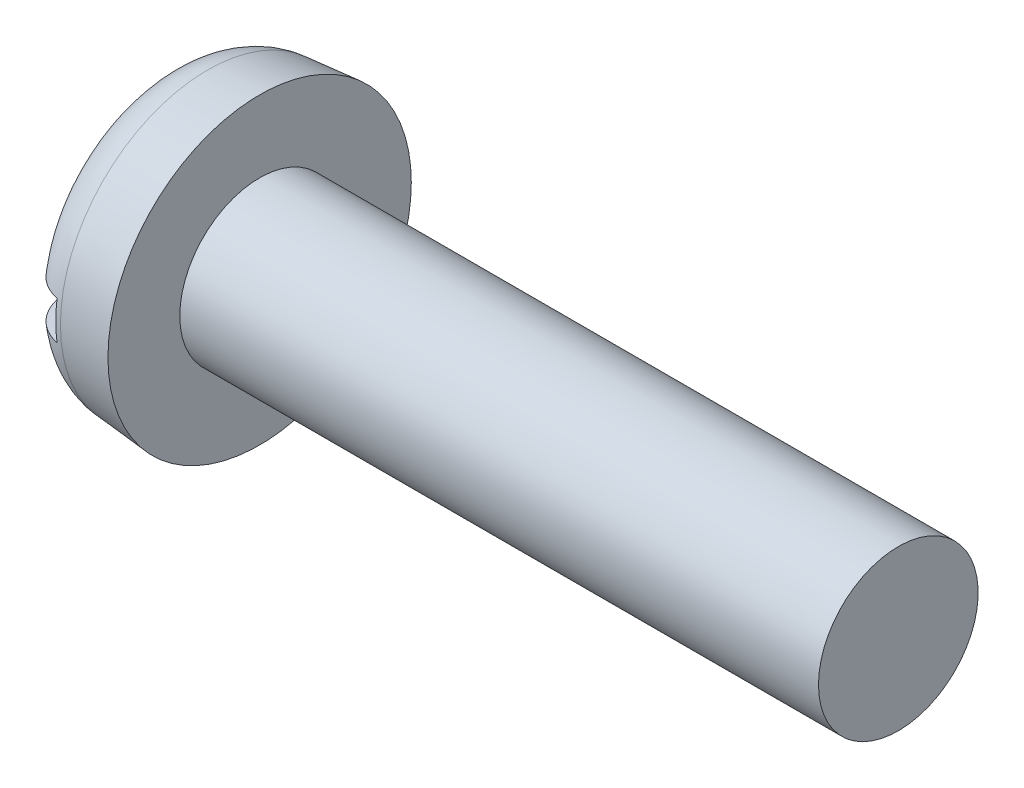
ISO-10303-21;
HEADER;
FILE_DESCRIPTION(('STEP AP214'),'2;1');
FILE_NAME('part.step','',(''),(''),'','','');
FILE_SCHEMA(('AUTOMOTIVE_DESIGN { 1 0 10303 214 1 1 1 1 }'));
ENDSEC;
DATA;
#1=APPLICATION_CONTEXT('core data for automotive mechanical design processes');
#2=APPLICATION_PROTOCOL_DEFINITION('international standard','automotive_design',2000,#1);
#3=PRODUCT_CONTEXT('',#1,'mechanical');
#4=PRODUCT('Part','Part','',(#3));
#5=PRODUCT_RELATED_PRODUCT_CATEGORY('part','',(#4));
#6=PRODUCT_DEFINITION_FORMATION('','',#4);
#7=PRODUCT_DEFINITION_CONTEXT('part definition',#1,'design');
#8=PRODUCT_DEFINITION('design','',#6,#7);
#9=PRODUCT_DEFINITION_SHAPE('','',#8);
#10=(LENGTH_UNIT() NAMED_UNIT(*) SI_UNIT(.MILLI.,.METRE.));
#11=(NAMED_UNIT(*) PLANE_ANGLE_UNIT() SI_UNIT($,.RADIAN.));
#12=(NAMED_UNIT(*) SI_UNIT($,.STERADIAN.) SOLID_ANGLE_UNIT());
#13=UNCERTAINTY_MEASURE_WITH_UNIT(LENGTH_MEASURE(1.E-05),#10,'distance_accuracy_value','');
#14=(GEOMETRIC_REPRESENTATION_CONTEXT(3) GLOBAL_UNCERTAINTY_ASSIGNED_CONTEXT((#13)) GLOBAL_UNIT_ASSIGNED_CONTEXT((#10,
#11,#12)) REPRESENTATION_CONTEXT('',''));
#15=CARTESIAN_POINT('',(0.,0.,0.));
#16=DIRECTION('',(0.,0.,1.));
#17=DIRECTION('',(1.,0.,0.));
#18=AXIS2_PLACEMENT_3D('',#15,#16,#17);
#19=CARTESIAN_POINT('',(0.,0.,0.));
#20=DIRECTION('',(-1.,0.,0.));
#21=DIRECTION('',(0.,0.,1.));
#22=AXIS2_PLACEMENT_3D('',#19,#20,#21);
#23=PLANE('',#22);
#24=DIRECTION('',(0.,0.,-1.));
#25=VECTOR('',#24,1.);
#26=CARTESIAN_POINT('',(0.,0.599999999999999,4.75));
#27=LINE('',#26,#25);
#28=CARTESIAN_POINT('',(0.,0.599999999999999,3.05466870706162));
#29=VERTEX_POINT('',#28);
#30=CARTESIAN_POINT('',(0.,0.599999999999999,-3.05466870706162));
#31=VERTEX_POINT('',#30);
#32=EDGE_CURVE('E85',#29,#31,#27,.T.);
#33=ORIENTED_EDGE('',*,*,#32,.F.);
#34=CARTESIAN_POINT('',(0.,0.,0.));
#35=DIRECTION('',(-1.,0.,0.));
#36=DIRECTION('',(0.,0.,1.));
#37=AXIS2_PLACEMENT_3D('',#34,#35,#36);
#38=CIRCLE('',#37,3.11303724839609);
#39=EDGE_CURVE('E91',#29,#31,#38,.T.);
#40=ORIENTED_EDGE('',*,*,#39,.T.);
#41=EDGE_LOOP('',(#33,#40));
#42=FACE_BOUND('',#41,.T.);
#43=ADVANCED_FACE('F32',(#42),#23,.T.);
#44=CARTESIAN_POINT('',(-25.4,0.,0.));
#45=DIRECTION('',(-1.,0.,0.));
#46=DIRECTION('',(0.,0.,1.));
#47=AXIS2_PLACEMENT_3D('',#44,#45,#46);
#48=CYLINDRICAL_SURFACE('',#47,2.5);
#49=CARTESIAN_POINT('',(23.,0.,0.));
#50=DIRECTION('',(-1.,0.,0.));
#51=DIRECTION('',(0.,0.,1.));
#52=AXIS2_PLACEMENT_3D('',#49,#50,#51);
#53=CIRCLE('',#52,2.5);
#54=CARTESIAN_POINT('',(23.,0.,2.5));
#55=VERTEX_POINT('',#54);
#56=EDGE_CURVE('E92',#55,#55,#53,.T.);
#57=ORIENTED_EDGE('',*,*,#56,.T.);
#58=EDGE_LOOP('',(#57));
#59=FACE_BOUND('',#58,.T.);
#60=CARTESIAN_POINT('',(3.,0.,0.));
#61=DIRECTION('',(-1.,0.,0.));
#62=DIRECTION('',(0.,0.,1.));
#63=AXIS2_PLACEMENT_3D('',#60,#61,#62);
#64=CIRCLE('',#63,2.5);
#65=CARTESIAN_POINT('',(3.,0.,2.5));
#66=VERTEX_POINT('',#65);
#67=EDGE_CURVE('E149',#66,#66,#64,.T.);
#68=ORIENTED_EDGE('',*,*,#67,.F.);
#69=EDGE_LOOP('',(#68));
#70=FACE_BOUND('',#69,.T.);
#71=ADVANCED_FACE('F137',(#59,#70),#48,.T.);
#72=CARTESIAN_POINT('',(23.,2.5,0.));
#73=DIRECTION('',(1.,0.,0.));
#74=DIRECTION('',(0.,0.,-1.));
#75=AXIS2_PLACEMENT_3D('',#72,#73,#74);
#76=PLANE('',#75);
#77=ORIENTED_EDGE('',*,*,#56,.F.);
#78=EDGE_LOOP('',(#77));
#79=FACE_BOUND('',#78,.T.);
#80=ADVANCED_FACE('F135',(#79),#76,.T.);
#81=DIRECTION('',(0.,0.,1.));
#82=VECTOR('',#81,1.);
#83=CARTESIAN_POINT('',(0.,-0.599999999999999,-4.75));
#84=LINE('',#83,#82);
#85=CARTESIAN_POINT('',(0.,-0.599999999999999,-3.05466870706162));
#86=VERTEX_POINT('',#85);
#87=CARTESIAN_POINT('',(0.,-0.6,3.05466870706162));
#88=VERTEX_POINT('',#87);
#89=EDGE_CURVE('E76',#86,#88,#84,.T.);
#90=ORIENTED_EDGE('',*,*,#89,.F.);
#91=EDGE_CURVE('E83',#86,#88,#38,.T.);
#92=ORIENTED_EDGE('',*,*,#91,.T.);
#93=EDGE_LOOP('',(#90,#92));
#94=FACE_BOUND('',#93,.T.);
#95=ADVANCED_FACE('F82',(#94),#23,.T.);
#96=CARTESIAN_POINT('',(0.,0.,0.));
#97=DIRECTION('',(1.,0.,0.));
#98=DIRECTION('',(0.,0.,-1.));
#99=AXIS2_PLACEMENT_3D('',#96,#97,#98);
#100=CONICAL_SURFACE('',#99,4.48753400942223,0.0872664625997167);
#101=CARTESIAN_POINT('',(1.36926638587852,0.,0.));
#102=DIRECTION('',(-1.,0.,0.));
#103=DIRECTION('',(0.,0.,1.));
#104=AXIS2_PLACEMENT_3D('',#101,#102,#103);
#105=CIRCLE('',#104,4.60732929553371);
#106=CARTESIAN_POINT('',(1.36926638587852,0.,4.60732929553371));
#107=VERTEX_POINT('',#106);
#108=EDGE_CURVE('E95',#107,#107,#105,.F.);
#109=ORIENTED_EDGE('',*,*,#108,.T.);
#110=EDGE_LOOP('',(#109));
#111=FACE_BOUND('',#110,.T.);
#112=CARTESIAN_POINT('',(3.,0.,0.));
#113=DIRECTION('',(-1.,0.,0.));
#114=DIRECTION('',(0.,0.,1.));
#115=AXIS2_PLACEMENT_3D('',#112,#113,#114);
#116=CIRCLE('',#115,4.75);
#117=CARTESIAN_POINT('',(3.,0.,4.75));
#118=VERTEX_POINT('',#117);
#119=EDGE_CURVE('E97',#118,#118,#116,.T.);
#120=ORIENTED_EDGE('',*,*,#119,.T.);
#121=EDGE_LOOP('',(#120));
#122=FACE_BOUND('',#121,.T.);
#123=ADVANCED_FACE('F128',(#111,#122),#100,.T.);
#124=CARTESIAN_POINT('',(3.,2.5,0.));
#125=DIRECTION('',(-1.,0.,0.));
#126=DIRECTION('',(0.,0.,1.));
#127=AXIS2_PLACEMENT_3D('',#124,#125,#126);
#128=PLANE('',#127);
#129=ORIENTED_EDGE('',*,*,#119,.F.);
#130=EDGE_LOOP('',(#129));
#131=FACE_BOUND('',#130,.T.);
#132=ORIENTED_EDGE('',*,*,#67,.T.);
#133=EDGE_LOOP('',(#132));
#134=FACE_BOUND('',#133,.T.);
#135=ADVANCED_FACE('F124',(#131,#134),#128,.F.);
#136=CARTESIAN_POINT('',(1.5,0.,0.));
#137=DIRECTION('',(-1.,0.,0.));
#138=DIRECTION('',(0.,0.,1.));
#139=AXIS2_PLACEMENT_3D('',#136,#137,#138);
#140=TOROIDAL_SURFACE('',#139,3.11303724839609,1.5);
#141=CARTESIAN_POINT('',(0.474243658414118,0.599999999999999,-4.16448807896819));
#142=CARTESIAN_POINT('',(0.535197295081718,0.599999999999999,-4.2222007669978));
#143=CARTESIAN_POINT('',(0.601040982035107,0.599999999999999,-4.27483380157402));
#144=CARTESIAN_POINT('',(0.740675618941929,0.599999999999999,-4.36835495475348));
#145=CARTESIAN_POINT('',(0.814475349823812,0.599999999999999,-4.40922990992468));
#146=CARTESIAN_POINT('',(0.967890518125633,0.599999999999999,-4.47797693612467));
#147=CARTESIAN_POINT('',(1.04750461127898,0.599999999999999,-4.50585200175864));
#148=CARTESIAN_POINT('',(1.21027286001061,0.599999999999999,-4.54777716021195));
#149=CARTESIAN_POINT('',(1.29342617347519,0.599999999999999,-4.56183052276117));
#150=CARTESIAN_POINT('',(1.46061786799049,0.599999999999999,-4.57568541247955));
#151=CARTESIAN_POINT('',(1.54465212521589,0.599999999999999,-4.57553672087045));
#152=CARTESIAN_POINT('',(1.71150157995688,0.599999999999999,-4.56111544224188));
#153=CARTESIAN_POINT('',(1.79431675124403,0.599999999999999,-4.546842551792));
#154=CARTESIAN_POINT('',(1.95628107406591,0.599999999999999,-4.50461633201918));
#155=CARTESIAN_POINT('',(2.03543426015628,0.599999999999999,-4.47667847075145));
#156=CARTESIAN_POINT('',(2.18794473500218,0.599999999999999,-4.40794662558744));
#157=CARTESIAN_POINT('',(2.26130200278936,0.599999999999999,-4.36715259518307));
#158=CARTESIAN_POINT('',(2.40037319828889,0.599999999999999,-4.27376142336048));
#159=CARTESIAN_POINT('',(2.46606492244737,0.599999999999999,-4.22113122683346));
#160=CARTESIAN_POINT('',(2.58775416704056,0.599999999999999,-4.10565865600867));
#161=CARTESIAN_POINT('',(2.64375146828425,0.599999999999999,-4.04281605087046));
#162=CARTESIAN_POINT('',(2.7448997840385,0.599999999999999,-3.90824759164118));
#163=CARTESIAN_POINT('',(2.78997229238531,0.599999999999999,-3.83646274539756));
#164=CARTESIAN_POINT('',(2.86758143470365,0.599999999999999,-3.6864129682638));
#165=CARTESIAN_POINT('',(2.90011748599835,0.599999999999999,-3.60814773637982));
#166=CARTESIAN_POINT('',(2.95215516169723,0.599999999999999,-3.44640006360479));
#167=CARTESIAN_POINT('',(2.9715017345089,0.599999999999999,-3.36286776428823));
#168=CARTESIAN_POINT('',(2.99613620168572,0.599999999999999,-3.19375865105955));
#169=CARTESIAN_POINT('',(3.00142305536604,0.599999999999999,-3.10818168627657));
#170=CARTESIAN_POINT('',(2.9978948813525,0.599999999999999,-2.93593785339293));
#171=CARTESIAN_POINT('',(2.98885075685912,0.599999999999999,-2.84927570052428));
#172=CARTESIAN_POINT('',(2.95661294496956,0.599999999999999,-2.67862588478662));
#173=CARTESIAN_POINT('',(2.93341783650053,0.599999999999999,-2.59463849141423));
#174=CARTESIAN_POINT('',(2.87305940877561,0.599999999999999,-2.43009011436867));
#175=CARTESIAN_POINT('',(2.8356478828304,0.599999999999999,-2.3496201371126));
#176=CARTESIAN_POINT('',(2.74798933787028,0.599999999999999,-2.1959917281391));
#177=CARTESIAN_POINT('',(2.69774036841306,0.599999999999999,-2.12283440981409));
#178=CARTESIAN_POINT('',(2.58515210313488,0.599999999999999,-1.98517825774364));
#179=CARTESIAN_POINT('',(2.52268993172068,0.599999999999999,-1.92077976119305));
#180=CARTESIAN_POINT('',(2.3876474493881,0.599999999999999,-1.80360821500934));
#181=CARTESIAN_POINT('',(2.31506700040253,0.599999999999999,-1.75083532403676));
#182=CARTESIAN_POINT('',(2.16324197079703,0.599999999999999,-1.65981326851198));
#183=CARTESIAN_POINT('',(2.08415844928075,0.599999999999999,-1.62129637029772));
#184=CARTESIAN_POINT('',(1.92036681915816,0.599999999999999,-1.55909823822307));
#185=CARTESIAN_POINT('',(1.83566227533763,0.599999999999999,-1.53540769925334));
#186=CARTESIAN_POINT('',(1.66868507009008,0.599999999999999,-1.50512561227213));
#187=CARTESIAN_POINT('',(1.58658829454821,0.599999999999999,-1.4975631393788));
#188=CARTESIAN_POINT('',(1.42235866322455,0.599999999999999,-1.49703912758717));
#189=CARTESIAN_POINT('',(1.34022582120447,0.599999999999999,-1.50407401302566));
#190=CARTESIAN_POINT('',(1.18200056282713,0.599999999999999,-1.53172166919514));
#191=CARTESIAN_POINT('',(1.10580089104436,0.599999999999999,-1.55172937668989));
#192=CARTESIAN_POINT('',(0.957649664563,0.599999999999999,-1.60381093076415));
#193=CARTESIAN_POINT('',(0.885698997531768,0.599999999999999,-1.63588728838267));
#194=CARTESIAN_POINT('',(0.745245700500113,0.599999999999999,-1.71223681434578));
#195=CARTESIAN_POINT('',(0.676958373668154,0.599999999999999,-1.75690511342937));
#196=CARTESIAN_POINT('',(0.548253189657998,0.599999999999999,-1.85641398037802));
#197=CARTESIAN_POINT('',(0.487837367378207,0.599999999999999,-1.91125716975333));
#198=CARTESIAN_POINT('',(0.372604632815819,0.599999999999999,-2.0333995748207));
#199=CARTESIAN_POINT('',(0.318393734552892,0.599999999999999,-2.10127142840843));
#200=CARTESIAN_POINT('',(0.22172170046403,0.599999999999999,-2.24492747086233));
#201=CARTESIAN_POINT('',(0.179262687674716,0.599999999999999,-2.32071308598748));
#202=CARTESIAN_POINT('',(0.106126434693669,0.599999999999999,-2.48060945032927));
#203=CARTESIAN_POINT('',(0.0758504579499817,0.599999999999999,-2.56490423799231));
#204=CARTESIAN_POINT('',(0.0299480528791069,0.599999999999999,-2.737393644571));
#205=CARTESIAN_POINT('',(0.0143211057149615,0.599999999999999,-2.82558812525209));
#206=CARTESIAN_POINT('',(-0.00166405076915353,0.599999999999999,-3.00295249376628));
#207=CARTESIAN_POINT('',(-0.0020913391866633,0.599999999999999,-3.09211612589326));
#208=CARTESIAN_POINT('',(0.012315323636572,0.599999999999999,-3.26923006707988));
#209=CARTESIAN_POINT('',(0.0271518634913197,0.599999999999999,-3.35718016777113));
#210=CARTESIAN_POINT('',(0.0713942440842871,0.599999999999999,-3.52770551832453));
#211=CARTESIAN_POINT('',(0.100543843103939,0.599999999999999,-3.61034739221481));
#212=CARTESIAN_POINT('',(0.172532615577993,0.599999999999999,-3.7693538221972));
#213=CARTESIAN_POINT('',(0.215353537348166,0.599999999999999,-3.84572657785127));
#214=CARTESIAN_POINT('',(0.294810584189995,0.599999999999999,-3.9625299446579));
#215=CARTESIAN_POINT('',(0.327631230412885,0.599999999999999,-4.00560511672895));
#216=CARTESIAN_POINT('',(0.397705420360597,0.599999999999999,-4.08798619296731));
#217=CARTESIAN_POINT('',(0.434958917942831,0.599999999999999,-4.12729213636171));
#218=CARTESIAN_POINT('',(0.474243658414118,0.599999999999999,-4.16448807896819));
#219=B_SPLINE_CURVE_WITH_KNOTS('',3,(#141,#142,#143,#144,#145,#146,#147,#148,#149,#150,#151,
#152,#153,#154,#155,#156,#157,#158,#159,#160,#161,#162,#163,#164,#165,#166,#167,#168,#169,#170,
#171,#172,#173,#174,#175,#176,#177,#178,#179,#180,#181,#182,#183,#184,#185,#186,#187,#188,#189,
#190,#191,#192,#193,#194,#195,#196,#197,#198,#199,#200,#201,#202,#203,#204,#205,#206,#207,#208,
#209,#210,#211,#212,#213,#214,#215,#216,#217,#218),.UNSPECIFIED.,.T.,.F.,(4,2,2,2,2,2,2,2,2,2,2,
2,2,2,2,2,2,2,2,2,2,2,2,2,2,2,2,2,2,2,2,2,2,2,2,2,2,2,4),(0.,0.251627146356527,
0.503534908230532,0.755384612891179,1.00717472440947,1.25808229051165,1.50899524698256,
1.75962483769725,2.01025533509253,2.26159466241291,2.5129396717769,2.76604060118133,
3.01915329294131,3.27519243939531,3.53125053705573,3.79144347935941,4.05166255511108,
4.31665070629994,4.58167914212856,4.84952563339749,5.1173757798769,5.37990411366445,
5.64226751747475,5.88833003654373,6.13433228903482,6.36961414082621,6.60494497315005,
6.84869102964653,7.09249997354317,7.35191672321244,7.61138030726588,7.87880123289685,
8.14621268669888,8.41240865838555,8.67864978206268,8.94028930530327,9.20158098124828,
9.36375686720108,9.52593106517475),.UNSPECIFIED.);
#220=CARTESIAN_POINT('',(1.2,0.599999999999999,-4.54328342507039));
#221=VERTEX_POINT('',#220);
#222=EDGE_CURVE('E11',#31,#221,#219,.T.);
#223=ORIENTED_EDGE('',*,*,#222,.F.);
#224=ORIENTED_EDGE('',*,*,#39,.F.);
#225=CARTESIAN_POINT('',(0.642058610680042,0.599999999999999,1.78444467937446));
#226=CARTESIAN_POINT('',(0.708203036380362,0.599999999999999,1.73578880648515));
#227=CARTESIAN_POINT('',(0.778279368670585,0.599999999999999,1.69241067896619));
#228=CARTESIAN_POINT('',(0.924661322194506,0.599999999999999,1.61775076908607));
#229=CARTESIAN_POINT('',(1.00097010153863,0.599999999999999,1.58647516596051));
#230=CARTESIAN_POINT('',(1.15801751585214,0.599999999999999,1.537335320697));
#231=CARTESIAN_POINT('',(1.23876602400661,0.599999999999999,1.51950238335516));
#232=CARTESIAN_POINT('',(1.40212199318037,0.599999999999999,1.49831173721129));
#233=CARTESIAN_POINT('',(1.48472861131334,0.599999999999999,1.49494759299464));
#234=CARTESIAN_POINT('',(1.64595983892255,0.599999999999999,1.50270631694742));
#235=CARTESIAN_POINT('',(1.72461257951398,0.599999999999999,1.51326068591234));
#236=CARTESIAN_POINT('',(1.8790539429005,0.599999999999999,1.54733501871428));
#237=CARTESIAN_POINT('',(1.95484205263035,0.599999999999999,1.57085729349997));
#238=CARTESIAN_POINT('',(2.10217401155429,0.599999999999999,1.63005609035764));
#239=CARTESIAN_POINT('',(2.17368023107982,0.599999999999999,1.6658257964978));
#240=CARTESIAN_POINT('',(2.310172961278,0.599999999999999,1.74815983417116));
#241=CARTESIAN_POINT('',(2.37515789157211,0.599999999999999,1.79472677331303));
#242=CARTESIAN_POINT('',(2.50111037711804,0.599999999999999,1.90052230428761));
#243=CARTESIAN_POINT('',(2.56156048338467,0.599999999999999,1.96036731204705));
#244=CARTESIAN_POINT('',(2.67210720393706,0.599999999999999,2.08896077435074));
#245=CARTESIAN_POINT('',(2.72220143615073,0.599999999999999,2.15771127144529));
#246=CARTESIAN_POINT('',(2.81284735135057,0.599999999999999,2.30563751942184));
#247=CARTESIAN_POINT('',(2.85285618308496,0.599999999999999,2.38514674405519));
#248=CARTESIAN_POINT('',(2.91905433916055,0.599999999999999,2.54972911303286));
#249=CARTESIAN_POINT('',(2.94524280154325,0.599999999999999,2.63480260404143));
#250=CARTESIAN_POINT('',(2.98307112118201,0.599999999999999,2.80866920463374));
#251=CARTESIAN_POINT('',(2.9946229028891,0.599999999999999,2.89748154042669));
#252=CARTESIAN_POINT('',(3.00240662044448,0.599999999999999,3.07577878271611));
#253=CARTESIAN_POINT('',(2.998639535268,0.599999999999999,3.16526364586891));
#254=CARTESIAN_POINT('',(2.97592433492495,0.599999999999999,3.34090743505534));
#255=CARTESIAN_POINT('',(2.95720740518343,0.599999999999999,3.42709622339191));
#256=CARTESIAN_POINT('',(2.90529569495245,0.599999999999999,3.59499998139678));
#257=CARTESIAN_POINT('',(2.87210231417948,0.599999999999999,3.67671538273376));
#258=CARTESIAN_POINT('',(2.7928517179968,0.599999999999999,3.83175947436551));
#259=CARTESIAN_POINT('',(2.7470416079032,0.599999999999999,3.90521449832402));
#260=CARTESIAN_POINT('',(2.64356788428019,0.599999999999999,4.04323981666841));
#261=CARTESIAN_POINT('',(2.58590525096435,0.599999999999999,4.10781084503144));
#262=CARTESIAN_POINT('',(2.46128327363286,0.599999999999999,4.22525214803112));
#263=CARTESIAN_POINT('',(2.39447165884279,0.599999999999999,4.27827922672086));
#264=CARTESIAN_POINT('',(2.25282231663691,0.599999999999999,4.37223374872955));
#265=CARTESIAN_POINT('',(2.17798504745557,0.599999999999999,4.41316188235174));
#266=CARTESIAN_POINT('',(2.02319107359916,0.599999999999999,4.48136089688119));
#267=CARTESIAN_POINT('',(1.94329070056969,0.599999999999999,4.50875968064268));
#268=CARTESIAN_POINT('',(1.78001182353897,0.599999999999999,4.54967680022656));
#269=CARTESIAN_POINT('',(1.69663343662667,0.599999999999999,4.5631956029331));
#270=CARTESIAN_POINT('',(1.52922201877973,0.599999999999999,4.57591948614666));
#271=CARTESIAN_POINT('',(1.44519451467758,0.599999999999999,4.57519739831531));
#272=CARTESIAN_POINT('',(1.27845728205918,0.599999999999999,4.55963992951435));
#273=CARTESIAN_POINT('',(1.19574753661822,0.599999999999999,4.54480472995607));
#274=CARTESIAN_POINT('',(1.0340786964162,0.599999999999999,4.50147996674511));
#275=CARTESIAN_POINT('',(0.95511580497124,0.599999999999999,4.47300456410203));
#276=CARTESIAN_POINT('',(0.803072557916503,0.599999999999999,4.40323812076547));
#277=CARTESIAN_POINT('',(0.729992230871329,0.599999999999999,4.36194701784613));
#278=CARTESIAN_POINT('',(0.59154832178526,0.599999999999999,4.26761123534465));
#279=CARTESIAN_POINT('',(0.526207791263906,0.599999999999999,4.21453273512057));
#280=CARTESIAN_POINT('',(0.405289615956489,0.599999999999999,4.09822911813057));
#281=CARTESIAN_POINT('',(0.349712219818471,0.599999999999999,4.03500374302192));
#282=CARTESIAN_POINT('',(0.249458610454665,0.599999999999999,3.89973755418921));
#283=CARTESIAN_POINT('',(0.204862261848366,0.599999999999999,3.82763756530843));
#284=CARTESIAN_POINT('',(0.128249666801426,0.599999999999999,3.67704118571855));
#285=CARTESIAN_POINT('',(0.0962340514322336,0.599999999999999,3.59854447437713));
#286=CARTESIAN_POINT('',(0.0452695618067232,0.599999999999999,3.43641182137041));
#287=CARTESIAN_POINT('',(0.0264776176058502,0.599999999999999,3.35272657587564));
#288=CARTESIAN_POINT('',(0.00296961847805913,0.599999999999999,3.18340853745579));
#289=CARTESIAN_POINT('',(-0.00174593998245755,0.599999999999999,3.09777567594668));
#290=CARTESIAN_POINT('',(0.00293340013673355,0.599999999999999,2.92551527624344));
#291=CARTESIAN_POINT('',(0.0125572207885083,0.599999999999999,2.83889398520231));
#292=CARTESIAN_POINT('',(0.045943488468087,0.599999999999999,2.66839997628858));
#293=CARTESIAN_POINT('',(0.0697105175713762,0.599999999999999,2.58452815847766));
#294=CARTESIAN_POINT('',(0.131206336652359,0.599999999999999,2.42028022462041));
#295=CARTESIAN_POINT('',(0.169188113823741,0.599999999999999,2.3399989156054));
#296=CARTESIAN_POINT('',(0.257932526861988,0.599999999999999,2.18690708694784));
#297=CARTESIAN_POINT('',(0.308683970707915,0.599999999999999,2.11409010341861));
#298=CARTESIAN_POINT('',(0.405756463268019,0.599999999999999,1.9970345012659));
#299=CARTESIAN_POINT('',(0.449343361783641,0.599999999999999,1.9505006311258));
#300=CARTESIAN_POINT('',(0.54185180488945,0.599999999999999,1.86306846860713));
#301=CARTESIAN_POINT('',(0.590773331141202,0.599999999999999,1.82217015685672));
#302=CARTESIAN_POINT('',(0.642058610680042,0.599999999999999,1.78444467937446));
#303=B_SPLINE_CURVE_WITH_KNOTS('',3,(#225,#226,#227,#228,#229,#230,#231,#232,#233,#234,#235,
#236,#237,#238,#239,#240,#241,#242,#243,#244,#245,#246,#247,#248,#249,#250,#251,#252,#253,#254,
#255,#256,#257,#258,#259,#260,#261,#262,#263,#264,#265,#266,#267,#268,#269,#270,#271,#272,#273,
#274,#275,#276,#277,#278,#279,#280,#281,#282,#283,#284,#285,#286,#287,#288,#289,#290,#291,#292,
#293,#294,#295,#296,#297,#298,#299,#300,#301,#302),.UNSPECIFIED.,.T.,.F.,(4,2,2,2,2,2,2,2,2,2,2,
2,2,2,2,2,2,2,2,2,2,2,2,2,2,2,2,2,2,2,2,2,2,2,2,2,2,2,4),(0.,0.24612605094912,0.492377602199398,
0.739200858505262,0.985914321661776,1.22285638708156,1.45984069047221,1.69866969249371,
1.93755643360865,2.19161852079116,2.4457389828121,2.7115111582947,2.97729990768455,
3.24468054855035,3.51204410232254,3.77535136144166,4.03863316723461,4.29708605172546,
4.55551757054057,4.81018291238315,5.06483372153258,5.31702870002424,5.56921519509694,
5.82011227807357,6.07100613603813,6.32164008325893,6.57227524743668,6.8236390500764,
7.07500925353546,7.32815697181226,7.58131738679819,7.83743366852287,8.09355898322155,
8.35381727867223,8.61415993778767,8.87937525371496,9.14435892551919,9.33519415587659,
9.52602873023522),.UNSPECIFIED.);
#304=CARTESIAN_POINT('',(1.2,0.599999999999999,4.54328342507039));
#305=VERTEX_POINT('',#304);
#306=EDGE_CURVE('E109',#305,#29,#303,.T.);
#307=ORIENTED_EDGE('',*,*,#306,.F.);
#308=CARTESIAN_POINT('',(1.2,0.,0.));
#309=DIRECTION('',(-1.,0.,0.));
#310=DIRECTION('',(0.,0.,1.));
#311=AXIS2_PLACEMENT_3D('',#308,#309,#310);
#312=CIRCLE('',#311,4.582731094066);
#313=CARTESIAN_POINT('',(1.2,-0.6,4.54328342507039));
#314=VERTEX_POINT('',#313);
#315=EDGE_CURVE('E103',#305,#314,#312,.F.);
#316=ORIENTED_EDGE('',*,*,#315,.T.);
#317=CARTESIAN_POINT('',(0.642058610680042,-0.6,1.78444467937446));
#318=CARTESIAN_POINT('',(0.570752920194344,-0.6,1.83690352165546));
#319=CARTESIAN_POINT('',(0.503916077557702,-0.6,1.89557553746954));
#320=CARTESIAN_POINT('',(0.380973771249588,-0.6,2.02337981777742));
#321=CARTESIAN_POINT('',(0.324888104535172,-0.6,2.09253096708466));
#322=CARTESIAN_POINT('',(0.225075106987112,-0.6,2.23912059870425));
#323=CARTESIAN_POINT('',(0.181331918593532,-0.6,2.31654826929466));
#324=CARTESIAN_POINT('',(0.10735821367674,-0.6,2.4775679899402));
#325=CARTESIAN_POINT('',(0.0771217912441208,-0.6,2.56115732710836));
#326=CARTESIAN_POINT('',(0.0308710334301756,-0.6,2.732939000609));
#327=CARTESIAN_POINT('',(0.0149771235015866,-0.6,2.82116384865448));
#328=CARTESIAN_POINT('',(-0.0015567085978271,-0.6,2.99904386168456));
#329=CARTESIAN_POINT('',(-0.00219606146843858,-0.6,3.08869907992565));
#330=CARTESIAN_POINT('',(0.0118531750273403,-0.6,3.26558059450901));
#331=CARTESIAN_POINT('',(0.0263341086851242,-0.6,3.35282334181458));
#332=CARTESIAN_POINT('',(0.0700194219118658,-0.6,3.52354291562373));
#333=CARTESIAN_POINT('',(0.099222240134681,-0.6,3.60702014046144));
#334=CARTESIAN_POINT('',(0.170926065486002,-0.6,3.76619303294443));
#335=CARTESIAN_POINT('',(0.213170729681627,-0.6,3.84200419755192));
#336=CARTESIAN_POINT('',(0.309975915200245,-0.6,3.98530836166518));
#337=CARTESIAN_POINT('',(0.364535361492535,-0.6,4.05280208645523));
#338=CARTESIAN_POINT('',(0.483508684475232,-0.6,4.1764763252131));
#339=CARTESIAN_POINT('',(0.5477595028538,-0.6,4.23281374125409));
#340=CARTESIAN_POINT('',(0.684891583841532,-0.6,4.33376627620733));
#341=CARTESIAN_POINT('',(0.757772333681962,-0.6,4.37838209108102));
#342=CARTESIAN_POINT('',(0.909277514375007,-0.6,4.45415785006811));
#343=CARTESIAN_POINT('',(0.98783477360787,-0.6,4.4854521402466));
#344=CARTESIAN_POINT('',(1.14910626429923,-0.6,4.53432193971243));
#345=CARTESIAN_POINT('',(1.23182034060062,-0.6,4.55189796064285));
#346=CARTESIAN_POINT('',(1.39854874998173,-0.6,4.57274942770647));
#347=CARTESIAN_POINT('',(1.48255291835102,-0.6,4.57610622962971));
#348=CARTESIAN_POINT('',(1.64992840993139,-0.6,4.56864397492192));
#349=CARTESIAN_POINT('',(1.73329974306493,-0.6,4.55782514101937));
#350=CARTESIAN_POINT('',(1.89690556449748,-0.6,4.5223590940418));
#351=CARTESIAN_POINT('',(1.97714487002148,-0.6,4.49773409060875));
#352=CARTESIAN_POINT('',(2.13236381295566,-0.6,4.43539277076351));
#353=CARTESIAN_POINT('',(2.20734343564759,-0.6,4.39767641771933));
#354=CARTESIAN_POINT('',(2.35011399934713,-0.6,4.31014761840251));
#355=CARTESIAN_POINT('',(2.41788774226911,-0.6,4.26030712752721));
#356=CARTESIAN_POINT('',(2.54417141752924,-0.6,4.15002218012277));
#357=CARTESIAN_POINT('',(2.60268114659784,-0.6,4.08957749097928));
#358=CARTESIAN_POINT('',(2.70919785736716,-0.6,3.9593981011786));
#359=CARTESIAN_POINT('',(2.75713464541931,-0.6,3.88960598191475));
#360=CARTESIAN_POINT('',(2.84075534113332,-0.6,3.74303514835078));
#361=CARTESIAN_POINT('',(2.8764387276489,-0.6,3.66625613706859));
#362=CARTESIAN_POINT('',(2.93498131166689,-0.6,3.50699921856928));
#363=CARTESIAN_POINT('',(2.95769541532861,-0.6,3.42446799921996));
#364=CARTESIAN_POINT('',(2.98917609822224,-0.6,3.25679047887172));
#365=CARTESIAN_POINT('',(2.99794169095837,-0.6,3.17164399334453));
#366=CARTESIAN_POINT('',(3.00144063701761,-0.6,2.99973325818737));
#367=CARTESIAN_POINT('',(2.99595250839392,-0.6,2.91296452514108));
#368=CARTESIAN_POINT('',(2.97076041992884,-0.6,2.74151789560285));
#369=CARTESIAN_POINT('',(2.95105508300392,-0.6,2.6568402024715));
#370=CARTESIAN_POINT('',(2.8975856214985,-0.6,2.49032583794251));
#371=CARTESIAN_POINT('',(2.86356984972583,-0.6,2.40856994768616));
#372=CARTESIAN_POINT('',(2.78246737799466,-0.6,2.25181146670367));
#373=CARTESIAN_POINT('',(2.73537879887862,-0.6,2.17680984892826));
#374=CARTESIAN_POINT('',(2.6287380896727,-0.6,2.03476656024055));
#375=CARTESIAN_POINT('',(2.56903700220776,-0.6,1.96783656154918));
#376=CARTESIAN_POINT('',(2.43909597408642,-0.6,1.84509773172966));
#377=CARTESIAN_POINT('',(2.36885525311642,-0.6,1.7892897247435));
#378=CARTESIAN_POINT('',(2.22077231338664,-0.6,1.6915159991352));
#379=CARTESIAN_POINT('',(2.14305625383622,-0.6,1.64935982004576));
#380=CARTESIAN_POINT('',(1.98134627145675,-0.6,1.57962775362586));
#381=CARTESIAN_POINT('',(1.89735630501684,-0.6,1.55204276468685));
#382=CARTESIAN_POINT('',(1.73074700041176,-0.6,1.51405337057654));
#383=CARTESIAN_POINT('',(1.64833577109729,-0.6,1.50273689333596));
#384=CARTESIAN_POINT('',(1.48280159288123,-0.6,1.49493998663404));
#385=CARTESIAN_POINT('',(1.39967868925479,-0.6,1.49845862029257));
#386=CARTESIAN_POINT('',(1.23954957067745,-0.6,1.5195684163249));
#387=CARTESIAN_POINT('',(1.16244637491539,-0.6,1.53644040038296));
#388=CARTESIAN_POINT('',(1.01210690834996,-0.6,1.58254863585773));
#389=CARTESIAN_POINT('',(0.938866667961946,-0.6,1.61177190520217));
#390=CARTESIAN_POINT('',(0.828774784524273,-0.6,1.66615585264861));
#391=CARTESIAN_POINT('',(0.789995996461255,-0.6,1.68752043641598));
#392=CARTESIAN_POINT('',(0.714458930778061,-0.6,1.73355428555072));
#393=CARTESIAN_POINT('',(0.677700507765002,-0.6,1.75822331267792));
#394=CARTESIAN_POINT('',(0.642058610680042,-0.6,1.78444467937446));
#395=B_SPLINE_CURVE_WITH_KNOTS('',3,(#317,#318,#319,#320,#321,#322,#323,#324,#325,#326,#327,
#328,#329,#330,#331,#332,#333,#334,#335,#336,#337,#338,#339,#340,#341,#342,#343,#344,#345,#346,
#347,#348,#349,#350,#351,#352,#353,#354,#355,#356,#357,#358,#359,#360,#361,#362,#363,#364,#365,
#366,#367,#368,#369,#370,#371,#372,#373,#374,#375,#376,#377,#378,#379,#380,#381,#382,#383,#384,
#385,#386,#387,#388,#389,#390,#391,#392,#393,#394),.UNSPECIFIED.,.T.,.F.,(4,2,2,2,2,2,2,2,2,2,2,
2,2,2,2,2,2,2,2,2,2,2,2,2,2,2,2,2,2,2,2,2,2,2,2,2,2,2,4),(0.,0.265404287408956,
0.531292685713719,0.796837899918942,1.0622668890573,1.32990433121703,1.59755176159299,
1.86157117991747,2.12556260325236,2.38466409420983,2.64374297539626,2.89886888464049,
3.15397964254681,3.40645291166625,3.65891676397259,3.90993416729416,4.16094762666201,
4.41155844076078,4.66216995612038,4.91336677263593,5.1645691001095,5.41739205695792,
5.67022576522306,5.92583525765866,6.18146282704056,6.44108615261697,6.70073462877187,
6.96515356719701,7.22961053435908,7.49738541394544,7.76518012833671,8.0290593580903,
8.2927735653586,8.54103382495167,8.78927840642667,9.02499451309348,9.2604634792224,
9.39313443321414,9.5257958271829),.UNSPECIFIED.);
#396=EDGE_CURVE('E90',#88,#314,#395,.T.);
#397=ORIENTED_EDGE('',*,*,#396,.F.);
#398=ORIENTED_EDGE('',*,*,#91,.F.);
#399=CARTESIAN_POINT('',(0.474243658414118,-0.599999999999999,-4.16448807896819));
#400=CARTESIAN_POINT('',(0.412409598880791,-0.599999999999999,-4.10593108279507));
#401=CARTESIAN_POINT('',(0.35551684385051,-0.599999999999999,-4.04205754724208));
#402=CARTESIAN_POINT('',(0.253261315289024,-0.599999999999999,-3.90557965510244));
#403=CARTESIAN_POINT('',(0.207914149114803,-0.599999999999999,-3.83296367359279));
#404=CARTESIAN_POINT('',(0.130063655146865,-0.599999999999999,-3.68123851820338));
#405=CARTESIAN_POINT('',(0.0975468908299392,-0.599999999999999,-3.6021362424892));
#406=CARTESIAN_POINT('',(0.0461131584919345,-0.599999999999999,-3.43965944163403));
#407=CARTESIAN_POINT('',(0.027192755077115,-0.599999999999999,-3.35628600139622));
#408=CARTESIAN_POINT('',(0.00320871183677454,-0.599999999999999,-3.18666752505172));
#409=CARTESIAN_POINT('',(-0.00170544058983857,-0.599999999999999,-3.10040138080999));
#410=CARTESIAN_POINT('',(0.00275015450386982,-0.599999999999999,-2.92823768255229));
#411=CARTESIAN_POINT('',(0.012121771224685,-0.599999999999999,-2.84234017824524));
#412=CARTESIAN_POINT('',(0.0450616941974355,-0.599999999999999,-2.67171740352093));
#413=CARTESIAN_POINT('',(0.0688809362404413,-0.6,-2.58704058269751));
#414=CARTESIAN_POINT('',(0.130163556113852,-0.6,-2.42277478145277));
#415=CARTESIAN_POINT('',(0.16762851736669,-0.6,-2.34318639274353));
#416=CARTESIAN_POINT('',(0.255857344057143,-0.6,-2.19000637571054));
#417=CARTESIAN_POINT('',(0.306828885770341,-0.6,-2.11653425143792));
#418=CARTESIAN_POINT('',(0.420399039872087,-0.6,-1.97917572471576));
#419=CARTESIAN_POINT('',(0.482999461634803,-0.6,-1.91529081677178));
#420=CARTESIAN_POINT('',(0.618096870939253,-0.6,-1.79922493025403));
#421=CARTESIAN_POINT('',(0.69057820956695,-0.6,-1.74702578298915));
#422=CARTESIAN_POINT('',(0.843593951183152,-0.6,-1.65617143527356));
#423=CARTESIAN_POINT('',(0.924125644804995,-0.6,-1.61751169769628));
#424=CARTESIAN_POINT('',(1.08726160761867,-0.6,-1.5568894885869));
#425=CARTESIAN_POINT('',(1.16962117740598,-0.6,-1.53427068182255));
#426=CARTESIAN_POINT('',(1.33705452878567,-0.6,-1.50426955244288));
#427=CARTESIAN_POINT('',(1.42212670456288,-0.6,-1.49687837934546));
#428=CARTESIAN_POINT('',(1.58668515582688,-0.6,-1.4977182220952));
#429=CARTESIAN_POINT('',(1.66617813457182,-0.6,-1.50497326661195));
#430=CARTESIAN_POINT('',(1.82279518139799,-0.6,-1.53279061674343));
#431=CARTESIAN_POINT('',(1.89991905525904,-0.6,-1.55335401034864));
#432=CARTESIAN_POINT('',(2.04948924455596,-0.6,-1.6067410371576));
#433=CARTESIAN_POINT('',(2.1219498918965,-0.6,-1.63952477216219));
#434=CARTESIAN_POINT('',(2.26079027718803,-0.6,-1.71610282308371));
#435=CARTESIAN_POINT('',(2.32716854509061,-0.6,-1.75989979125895));
#436=CARTESIAN_POINT('',(2.45624783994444,-0.6,-1.86010993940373));
#437=CARTESIAN_POINT('',(2.51847841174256,-0.6,-1.91712921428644));
#438=CARTESIAN_POINT('',(2.6330655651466,-0.6,-2.04035161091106));
#439=CARTESIAN_POINT('',(2.68541975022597,-0.6,-2.10655695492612));
#440=CARTESIAN_POINT('',(2.78137899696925,-0.6,-2.24995520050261));
#441=CARTESIAN_POINT('',(2.82440841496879,-0.6,-2.32753422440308));
#442=CARTESIAN_POINT('',(2.89698988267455,-0.6,-2.48876491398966));
#443=CARTESIAN_POINT('',(2.92654080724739,-0.599999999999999,-2.57241708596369));
#444=CARTESIAN_POINT('',(2.97147838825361,-0.599999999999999,-2.74436421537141));
#445=CARTESIAN_POINT('',(2.98671795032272,-0.599999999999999,-2.83269773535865));
#446=CARTESIAN_POINT('',(3.0019280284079,-0.599999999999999,-3.01067371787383));
#447=CARTESIAN_POINT('',(3.00189936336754,-0.599999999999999,-3.10031610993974));
#448=CARTESIAN_POINT('',(2.98653324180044,-0.599999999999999,-3.27703669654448));
#449=CARTESIAN_POINT('',(2.97140689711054,-0.599999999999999,-3.36413320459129));
#450=CARTESIAN_POINT('',(2.92646546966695,-0.599999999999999,-3.53445278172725));
#451=CARTESIAN_POINT('',(2.89665181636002,-0.599999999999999,-3.6176762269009));
#452=CARTESIAN_POINT('',(2.82379055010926,-0.599999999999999,-3.77624709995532));
#453=CARTESIAN_POINT('',(2.78099811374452,-0.599999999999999,-3.85171179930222));
#454=CARTESIAN_POINT('',(2.68316564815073,-0.599999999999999,-3.99423591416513));
#455=CARTESIAN_POINT('',(2.62812664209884,-0.599999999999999,-4.06129603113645));
#456=CARTESIAN_POINT('',(2.50827792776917,-0.599999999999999,-4.18404243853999));
#457=CARTESIAN_POINT('',(2.44362896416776,-0.599999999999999,-4.23988572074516));
#458=CARTESIAN_POINT('',(2.3057910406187,-0.599999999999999,-4.33979100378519));
#459=CARTESIAN_POINT('',(2.23260257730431,-0.599999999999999,-4.38385368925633));
#460=CARTESIAN_POINT('',(2.08057460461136,-0.599999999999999,-4.45849174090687));
#461=CARTESIAN_POINT('',(2.00180044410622,-0.599999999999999,-4.4892002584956));
#462=CARTESIAN_POINT('',(1.84020059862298,-0.599999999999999,-4.53687031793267));
#463=CARTESIAN_POINT('',(1.75737522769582,-0.599999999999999,-4.55383292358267));
#464=CARTESIAN_POINT('',(1.59053176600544,-0.599999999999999,-4.5734537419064));
#465=CARTESIAN_POINT('',(1.50652325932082,-0.599999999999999,-4.57619356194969));
#466=CARTESIAN_POINT('',(1.33921886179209,-0.599999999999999,-4.56750581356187));
#467=CARTESIAN_POINT('',(1.25592315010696,-0.599999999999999,-4.55607478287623));
#468=CARTESIAN_POINT('',(1.09252935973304,-0.599999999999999,-4.51940184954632));
#469=CARTESIAN_POINT('',(1.01242810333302,-0.599999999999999,-4.49417405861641));
#470=CARTESIAN_POINT('',(0.857658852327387,-0.599999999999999,-4.4306700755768));
#471=CARTESIAN_POINT('',(0.782984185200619,-0.599999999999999,-4.39241024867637));
#472=CARTESIAN_POINT('',(0.669478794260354,-0.599999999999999,-4.32168602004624));
#473=CARTESIAN_POINT('',(0.628240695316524,-0.599999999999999,-4.29300657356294));
#474=CARTESIAN_POINT('',(0.548844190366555,-0.599999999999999,-4.23166298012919));
#475=CARTESIAN_POINT('',(0.510685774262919,-0.599999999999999,-4.1989988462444));
#476=CARTESIAN_POINT('',(0.474243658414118,-0.599999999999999,-4.16448807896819));
#477=B_SPLINE_CURVE_WITH_KNOTS('',3,(#399,#400,#401,#402,#403,#404,#405,#406,#407,#408,#409,
#410,#411,#412,#413,#414,#415,#416,#417,#418,#419,#420,#421,#422,#423,#424,#425,#426,#427,#428,
#429,#430,#431,#432,#433,#434,#435,#436,#437,#438,#439,#440,#441,#442,#443,#444,#445,#446,#447,
#448,#449,#450,#451,#452,#453,#454,#455,#456,#457,#458,#459,#460,#461,#462,#463,#464,#465,#466,
#467,#468,#469,#470,#471,#472,#473,#474,#475,#476),.UNSPECIFIED.,.T.,.F.,(4,2,2,2,2,2,2,2,2,2,2,
2,2,2,2,2,2,2,2,2,2,2,2,2,2,2,2,2,2,2,2,2,2,2,2,2,2,2,4),(0.,0.25529644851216,0.510936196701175,
0.766307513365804,1.02161428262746,1.27963589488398,1.53769127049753,1.80036244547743,
2.06306411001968,2.330066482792,2.5971104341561,2.86373626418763,3.13027266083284,
3.38515155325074,3.63988226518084,3.87819866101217,4.11653454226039,4.35409900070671,
4.59172072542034,4.84382021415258,5.09598079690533,5.36088081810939,5.62580294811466,
5.89341910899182,6.16102091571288,6.42493252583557,6.6888184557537,6.94781983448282,
7.20679958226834,7.46185384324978,7.71689327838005,7.96932796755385,8.22174311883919,
8.47270835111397,8.72373491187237,8.97450519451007,9.22496172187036,9.37542205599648,
9.52588189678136),.UNSPECIFIED.);
#478=CARTESIAN_POINT('',(1.2,-0.599999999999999,-4.54328342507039));
#479=VERTEX_POINT('',#478);
#480=EDGE_CURVE('E44',#479,#86,#477,.T.);
#481=ORIENTED_EDGE('',*,*,#480,.F.);
#482=EDGE_CURVE('E56',#479,#221,#312,.F.);
#483=ORIENTED_EDGE('',*,*,#482,.T.);
#484=EDGE_LOOP('',(#223,#224,#307,#316,#397,#398,#481,#483));
#485=FACE_BOUND('',#484,.T.);
#486=ORIENTED_EDGE('',*,*,#108,.F.);
#487=EDGE_LOOP('',(#486));
#488=FACE_BOUND('',#487,.T.);
#489=ADVANCED_FACE('F34',(#485,#488),#140,.T.);
#490=CARTESIAN_POINT('',(1.2,0.599999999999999,4.75));
#491=DIRECTION('',(0.,1.,0.));
#492=DIRECTION('',(0.,0.,1.));
#493=AXIS2_PLACEMENT_3D('',#490,#491,#492);
#494=PLANE('',#493);
#495=ORIENTED_EDGE('',*,*,#222,.T.);
#496=DIRECTION('',(0.,0.,-1.));
#497=VECTOR('',#496,1.);
#498=CARTESIAN_POINT('',(1.2,0.599999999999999,4.75));
#499=LINE('',#498,#497);
#500=EDGE_CURVE('E84',#305,#221,#499,.T.);
#501=ORIENTED_EDGE('',*,*,#500,.F.);
#502=ORIENTED_EDGE('',*,*,#306,.T.);
#503=ORIENTED_EDGE('',*,*,#32,.T.);
#504=EDGE_LOOP('',(#495,#501,#502,#503));
#505=FACE_BOUND('',#504,.T.);
#506=ADVANCED_FACE('F116',(#505),#494,.F.);
#507=CARTESIAN_POINT('',(1.2,-0.599999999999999,-4.75));
#508=DIRECTION('',(0.,-1.,0.));
#509=DIRECTION('',(0.,0.,-1.));
#510=AXIS2_PLACEMENT_3D('',#507,#508,#509);
#511=PLANE('',#510);
#512=ORIENTED_EDGE('',*,*,#480,.T.);
#513=ORIENTED_EDGE('',*,*,#89,.T.);
#514=ORIENTED_EDGE('',*,*,#396,.T.);
#515=DIRECTION('',(0.,0.,1.));
#516=VECTOR('',#515,1.);
#517=CARTESIAN_POINT('',(1.2,-0.599999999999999,-4.75));
#518=LINE('',#517,#516);
#519=EDGE_CURVE('E51',#479,#314,#518,.T.);
#520=ORIENTED_EDGE('',*,*,#519,.F.);
#521=EDGE_LOOP('',(#512,#513,#514,#520));
#522=FACE_BOUND('',#521,.T.);
#523=ADVANCED_FACE('F75',(#522),#511,.F.);
#524=CARTESIAN_POINT('',(1.2,0.599999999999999,-4.75));
#525=DIRECTION('',(-1.,0.,0.));
#526=DIRECTION('',(0.,0.,1.));
#527=AXIS2_PLACEMENT_3D('',#524,#525,#526);
#528=PLANE('',#527);
#529=ORIENTED_EDGE('',*,*,#519,.T.);
#530=ORIENTED_EDGE('',*,*,#315,.F.);
#531=ORIENTED_EDGE('',*,*,#500,.T.);
#532=ORIENTED_EDGE('',*,*,#482,.F.);
#533=EDGE_LOOP('',(#529,#530,#531,#532));
#534=FACE_BOUND('',#533,.T.);
#535=ADVANCED_FACE('F115',(#534),#528,.T.);
#536=CLOSED_SHELL('',(#43,#71,#80,#95,#123,#135,#489,#506,#523,#535));
#537=MANIFOLD_SOLID_BREP('B2',#536);
#538=ADVANCED_BREP_SHAPE_REPRESENTATION('',(#18,#537),#14);
#539=SHAPE_DEFINITION_REPRESENTATION(#9,#538);
ENDSEC;
END-ISO-10303-21;
